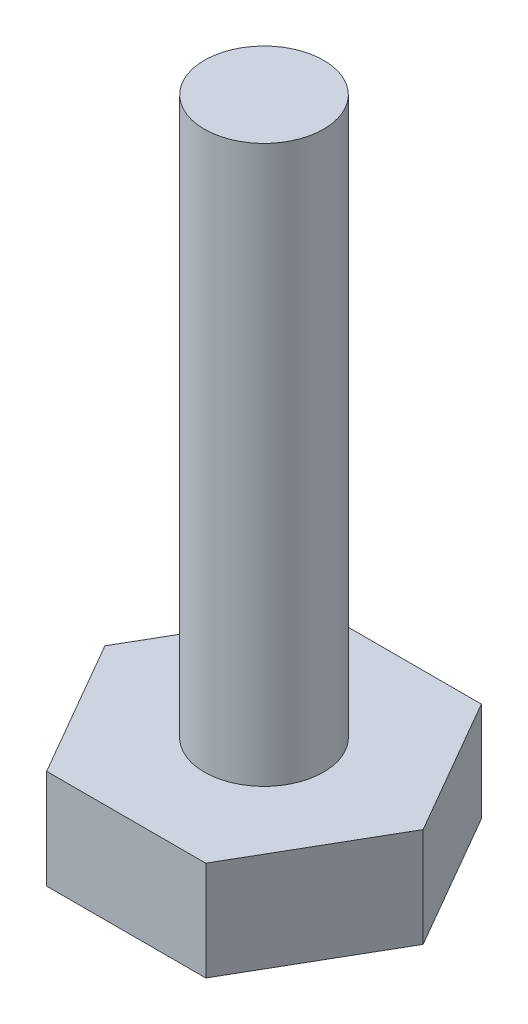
ISO-10303-21;
HEADER;
FILE_DESCRIPTION(('STEP AP214'),'2;1');
FILE_NAME('part.step','',(''),(''),'','','');
FILE_SCHEMA(('AUTOMOTIVE_DESIGN { 1 0 10303 214 1 1 1 1 }'));
ENDSEC;
DATA;
#1=APPLICATION_CONTEXT('core data for automotive mechanical design processes');
#2=APPLICATION_PROTOCOL_DEFINITION('international standard','automotive_design',2000,#1);
#3=PRODUCT_CONTEXT('',#1,'mechanical');
#4=PRODUCT('Part','Part','',(#3));
#5=PRODUCT_RELATED_PRODUCT_CATEGORY('part','',(#4));
#6=PRODUCT_DEFINITION_FORMATION('','',#4);
#7=PRODUCT_DEFINITION_CONTEXT('part definition',#1,'design');
#8=PRODUCT_DEFINITION('design','',#6,#7);
#9=PRODUCT_DEFINITION_SHAPE('','',#8);
#10=(LENGTH_UNIT() NAMED_UNIT(*) SI_UNIT(.MILLI.,.METRE.));
#11=(NAMED_UNIT(*) PLANE_ANGLE_UNIT() SI_UNIT($,.RADIAN.));
#12=(NAMED_UNIT(*) SI_UNIT($,.STERADIAN.) SOLID_ANGLE_UNIT());
#13=UNCERTAINTY_MEASURE_WITH_UNIT(LENGTH_MEASURE(1.E-05),#10,'distance_accuracy_value','');
#14=(GEOMETRIC_REPRESENTATION_CONTEXT(3) GLOBAL_UNCERTAINTY_ASSIGNED_CONTEXT((#13)) GLOBAL_UNIT_ASSIGNED_CONTEXT((#10,
#11,#12)) REPRESENTATION_CONTEXT('',''));
#15=CARTESIAN_POINT('',(0.,0.,0.));
#16=DIRECTION('',(0.,0.,1.));
#17=DIRECTION('',(1.,0.,0.));
#18=AXIS2_PLACEMENT_3D('',#15,#16,#17);
#19=CARTESIAN_POINT('',(20.,12.5,0.));
#20=DIRECTION('',(0.,1.,0.));
#21=DIRECTION('',(0.,0.,1.));
#22=AXIS2_PLACEMENT_3D('',#19,#20,#21);
#23=PLANE('',#22);
#24=DIRECTION('',(0.5,0.,-0.866025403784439));
#25=VECTOR('',#24,1.);
#26=CARTESIAN_POINT('',(9.99999999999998,12.5,17.3205080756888));
#27=LINE('',#26,#25);
#28=CARTESIAN_POINT('',(9.99999999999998,12.5,17.3205080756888));
#29=VERTEX_POINT('',#28);
#30=CARTESIAN_POINT('',(20.,12.5,0.));
#31=VERTEX_POINT('',#30);
#32=EDGE_CURVE('E132',#29,#31,#27,.T.);
#33=ORIENTED_EDGE('',*,*,#32,.T.);
#34=DIRECTION('',(-0.5,0.,-0.866025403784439));
#35=VECTOR('',#34,1.);
#36=CARTESIAN_POINT('',(20.,12.5,0.));
#37=LINE('',#36,#35);
#38=CARTESIAN_POINT('',(10.,12.5,-17.3205080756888));
#39=VERTEX_POINT('',#38);
#40=EDGE_CURVE('E90',#31,#39,#37,.T.);
#41=ORIENTED_EDGE('',*,*,#40,.T.);
#42=DIRECTION('',(-1.,0.,0.));
#43=VECTOR('',#42,1.);
#44=CARTESIAN_POINT('',(10.,12.5,-17.3205080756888));
#45=LINE('',#44,#43);
#46=CARTESIAN_POINT('',(-10.,12.5,-17.3205080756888));
#47=VERTEX_POINT('',#46);
#48=EDGE_CURVE('E103',#39,#47,#45,.T.);
#49=ORIENTED_EDGE('',*,*,#48,.T.);
#50=DIRECTION('',(-0.5,0.,0.866025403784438));
#51=VECTOR('',#50,1.);
#52=CARTESIAN_POINT('',(-10.,12.5,-17.3205080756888));
#53=LINE('',#52,#51);
#54=CARTESIAN_POINT('',(-20.,12.5,0.));
#55=VERTEX_POINT('',#54);
#56=EDGE_CURVE('E97',#47,#55,#53,.T.);
#57=ORIENTED_EDGE('',*,*,#56,.T.);
#58=DIRECTION('',(0.5,0.,0.866025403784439));
#59=VECTOR('',#58,1.);
#60=CARTESIAN_POINT('',(-20.,12.5,0.));
#61=LINE('',#60,#59);
#62=CARTESIAN_POINT('',(-10.,12.5,17.3205080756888));
#63=VERTEX_POINT('',#62);
#64=EDGE_CURVE('E101',#55,#63,#61,.T.);
#65=ORIENTED_EDGE('',*,*,#64,.T.);
#66=DIRECTION('',(1.,0.,0.));
#67=VECTOR('',#66,1.);
#68=CARTESIAN_POINT('',(-10.,12.5,17.3205080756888));
#69=LINE('',#68,#67);
#70=EDGE_CURVE('E53',#63,#29,#69,.T.);
#71=ORIENTED_EDGE('',*,*,#70,.T.);
#72=EDGE_LOOP('',(#33,#41,#49,#57,#65,#71));
#73=FACE_BOUND('',#72,.T.);
#74=CARTESIAN_POINT('',(0.,12.5,0.));
#75=DIRECTION('',(0.,1.,0.));
#76=DIRECTION('',(0.,0.,1.));
#77=AXIS2_PLACEMENT_3D('',#74,#75,#76);
#78=CIRCLE('',#77,7.5);
#79=CARTESIAN_POINT('',(0.,12.5,7.5));
#80=VERTEX_POINT('',#79);
#81=EDGE_CURVE('E172',#80,#80,#78,.T.);
#82=ORIENTED_EDGE('',*,*,#81,.F.);
#83=EDGE_LOOP('',(#82));
#84=FACE_BOUND('',#83,.T.);
#85=ADVANCED_FACE('F36',(#73,#84),#23,.T.);
#86=CARTESIAN_POINT('',(9.99999999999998,12.5,17.3205080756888));
#87=DIRECTION('',(-0.866025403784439,0.,-0.5));
#88=DIRECTION('',(-0.5,0.,0.866025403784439));
#89=AXIS2_PLACEMENT_3D('',#86,#87,#88);
#90=PLANE('',#89);
#91=DIRECTION('',(0.5,0.,-0.866025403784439));
#92=VECTOR('',#91,1.);
#93=CARTESIAN_POINT('',(9.99999999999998,0.,17.3205080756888));
#94=LINE('',#93,#92);
#95=CARTESIAN_POINT('',(9.99999999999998,0.,17.3205080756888));
#96=VERTEX_POINT('',#95);
#97=CARTESIAN_POINT('',(20.,0.,0.));
#98=VERTEX_POINT('',#97);
#99=EDGE_CURVE('E121',#96,#98,#94,.T.);
#100=ORIENTED_EDGE('',*,*,#99,.T.);
#101=DIRECTION('',(0.,-1.,0.));
#102=VECTOR('',#101,1.);
#103=CARTESIAN_POINT('',(20.,12.5,0.));
#104=LINE('',#103,#102);
#105=EDGE_CURVE('E11',#31,#98,#104,.T.);
#106=ORIENTED_EDGE('',*,*,#105,.F.);
#107=ORIENTED_EDGE('',*,*,#32,.F.);
#108=DIRECTION('',(0.,-1.,0.));
#109=VECTOR('',#108,1.);
#110=CARTESIAN_POINT('',(9.99999999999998,12.5,17.3205080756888));
#111=LINE('',#110,#109);
#112=EDGE_CURVE('E117',#29,#96,#111,.T.);
#113=ORIENTED_EDGE('',*,*,#112,.T.);
#114=EDGE_LOOP('',(#100,#106,#107,#113));
#115=FACE_BOUND('',#114,.T.);
#116=ADVANCED_FACE('F38',(#115),#90,.F.);
#117=CARTESIAN_POINT('',(20.,12.5,0.));
#118=DIRECTION('',(-0.866025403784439,0.,0.5));
#119=DIRECTION('',(0.5,0.,0.866025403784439));
#120=AXIS2_PLACEMENT_3D('',#117,#118,#119);
#121=PLANE('',#120);
#122=DIRECTION('',(-0.5,0.,-0.866025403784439));
#123=VECTOR('',#122,1.);
#124=CARTESIAN_POINT('',(20.,0.,0.));
#125=LINE('',#124,#123);
#126=CARTESIAN_POINT('',(10.,0.,-17.3205080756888));
#127=VERTEX_POINT('',#126);
#128=EDGE_CURVE('E124',#98,#127,#125,.T.);
#129=ORIENTED_EDGE('',*,*,#128,.T.);
#130=DIRECTION('',(0.,-1.,0.));
#131=VECTOR('',#130,1.);
#132=CARTESIAN_POINT('',(10.,12.5,-17.3205080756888));
#133=LINE('',#132,#131);
#134=EDGE_CURVE('E45',#39,#127,#133,.T.);
#135=ORIENTED_EDGE('',*,*,#134,.F.);
#136=ORIENTED_EDGE('',*,*,#40,.F.);
#137=ORIENTED_EDGE('',*,*,#105,.T.);
#138=EDGE_LOOP('',(#129,#135,#136,#137));
#139=FACE_BOUND('',#138,.T.);
#140=ADVANCED_FACE('F160',(#139),#121,.F.);
#141=CARTESIAN_POINT('',(10.,12.5,-17.3205080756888));
#142=DIRECTION('',(0.,0.,1.));
#143=DIRECTION('',(1.,0.,0.));
#144=AXIS2_PLACEMENT_3D('',#141,#142,#143);
#145=PLANE('',#144);
#146=DIRECTION('',(-1.,0.,0.));
#147=VECTOR('',#146,1.);
#148=CARTESIAN_POINT('',(10.,0.,-17.3205080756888));
#149=LINE('',#148,#147);
#150=CARTESIAN_POINT('',(-10.,0.,-17.3205080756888));
#151=VERTEX_POINT('',#150);
#152=EDGE_CURVE('E127',#127,#151,#149,.T.);
#153=ORIENTED_EDGE('',*,*,#152,.T.);
#154=DIRECTION('',(0.,-1.,0.));
#155=VECTOR('',#154,1.);
#156=CARTESIAN_POINT('',(-10.,12.5,-17.3205080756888));
#157=LINE('',#156,#155);
#158=EDGE_CURVE('E112',#47,#151,#157,.T.);
#159=ORIENTED_EDGE('',*,*,#158,.F.);
#160=ORIENTED_EDGE('',*,*,#48,.F.);
#161=ORIENTED_EDGE('',*,*,#134,.T.);
#162=EDGE_LOOP('',(#153,#159,#160,#161));
#163=FACE_BOUND('',#162,.T.);
#164=ADVANCED_FACE('F138',(#163),#145,.F.);
#165=CARTESIAN_POINT('',(-10.,12.5,-17.3205080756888));
#166=DIRECTION('',(0.866025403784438,0.,0.5));
#167=DIRECTION('',(0.5,0.,-0.866025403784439));
#168=AXIS2_PLACEMENT_3D('',#165,#166,#167);
#169=PLANE('',#168);
#170=DIRECTION('',(-0.5,0.,0.866025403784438));
#171=VECTOR('',#170,1.);
#172=CARTESIAN_POINT('',(-10.,0.,-17.3205080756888));
#173=LINE('',#172,#171);
#174=CARTESIAN_POINT('',(-20.,0.,0.));
#175=VERTEX_POINT('',#174);
#176=EDGE_CURVE('E111',#151,#175,#173,.T.);
#177=ORIENTED_EDGE('',*,*,#176,.T.);
#178=DIRECTION('',(0.,-1.,0.));
#179=VECTOR('',#178,1.);
#180=CARTESIAN_POINT('',(-20.,12.5,0.));
#181=LINE('',#180,#179);
#182=EDGE_CURVE('E108',#55,#175,#181,.T.);
#183=ORIENTED_EDGE('',*,*,#182,.F.);
#184=ORIENTED_EDGE('',*,*,#56,.F.);
#185=ORIENTED_EDGE('',*,*,#158,.T.);
#186=EDGE_LOOP('',(#177,#183,#184,#185));
#187=FACE_BOUND('',#186,.T.);
#188=ADVANCED_FACE('F109',(#187),#169,.F.);
#189=CARTESIAN_POINT('',(-20.,12.5,0.));
#190=DIRECTION('',(0.866025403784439,0.,-0.5));
#191=DIRECTION('',(-0.5,0.,-0.866025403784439));
#192=AXIS2_PLACEMENT_3D('',#189,#190,#191);
#193=PLANE('',#192);
#194=DIRECTION('',(0.5,0.,0.866025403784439));
#195=VECTOR('',#194,1.);
#196=CARTESIAN_POINT('',(-20.,0.,0.));
#197=LINE('',#196,#195);
#198=CARTESIAN_POINT('',(-10.,0.,17.3205080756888));
#199=VERTEX_POINT('',#198);
#200=EDGE_CURVE('E76',#175,#199,#197,.T.);
#201=ORIENTED_EDGE('',*,*,#200,.T.);
#202=DIRECTION('',(0.,-1.,0.));
#203=VECTOR('',#202,1.);
#204=CARTESIAN_POINT('',(-10.,12.5,17.3205080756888));
#205=LINE('',#204,#203);
#206=EDGE_CURVE('E113',#63,#199,#205,.T.);
#207=ORIENTED_EDGE('',*,*,#206,.F.);
#208=ORIENTED_EDGE('',*,*,#64,.F.);
#209=ORIENTED_EDGE('',*,*,#182,.T.);
#210=EDGE_LOOP('',(#201,#207,#208,#209));
#211=FACE_BOUND('',#210,.T.);
#212=ADVANCED_FACE('F115',(#211),#193,.F.);
#213=CARTESIAN_POINT('',(-10.,12.5,17.3205080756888));
#214=DIRECTION('',(0.,0.,-1.));
#215=DIRECTION('',(-1.,0.,0.));
#216=AXIS2_PLACEMENT_3D('',#213,#214,#215);
#217=PLANE('',#216);
#218=DIRECTION('',(1.,0.,0.));
#219=VECTOR('',#218,1.);
#220=CARTESIAN_POINT('',(-10.,0.,17.3205080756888));
#221=LINE('',#220,#219);
#222=EDGE_CURVE('E82',#199,#96,#221,.T.);
#223=ORIENTED_EDGE('',*,*,#222,.T.);
#224=ORIENTED_EDGE('',*,*,#112,.F.);
#225=ORIENTED_EDGE('',*,*,#70,.F.);
#226=ORIENTED_EDGE('',*,*,#206,.T.);
#227=EDGE_LOOP('',(#223,#224,#225,#226));
#228=FACE_BOUND('',#227,.T.);
#229=ADVANCED_FACE('F145',(#228),#217,.F.);
#230=CARTESIAN_POINT('',(20.,0.,0.));
#231=DIRECTION('',(0.,1.,0.));
#232=DIRECTION('',(0.,0.,1.));
#233=AXIS2_PLACEMENT_3D('',#230,#231,#232);
#234=PLANE('',#233);
#235=ORIENTED_EDGE('',*,*,#99,.F.);
#236=ORIENTED_EDGE('',*,*,#222,.F.);
#237=ORIENTED_EDGE('',*,*,#200,.F.);
#238=ORIENTED_EDGE('',*,*,#176,.F.);
#239=ORIENTED_EDGE('',*,*,#152,.F.);
#240=ORIENTED_EDGE('',*,*,#128,.F.);
#241=EDGE_LOOP('',(#235,#236,#237,#238,#239,#240));
#242=FACE_BOUND('',#241,.T.);
#243=ADVANCED_FACE('F141',(#242),#234,.F.);
#244=CARTESIAN_POINT('',(0.,82.5,0.));
#245=DIRECTION('',(0.,-1.,0.));
#246=DIRECTION('',(0.,0.,-1.));
#247=AXIS2_PLACEMENT_3D('',#244,#245,#246);
#248=CYLINDRICAL_SURFACE('',#247,7.5);
#249=CARTESIAN_POINT('',(0.,82.5,0.));
#250=DIRECTION('',(0.,1.,0.));
#251=DIRECTION('',(0.,0.,1.));
#252=AXIS2_PLACEMENT_3D('',#249,#250,#251);
#253=CIRCLE('',#252,7.5);
#254=CARTESIAN_POINT('',(0.,82.5,7.5));
#255=VERTEX_POINT('',#254);
#256=EDGE_CURVE('E125',#255,#255,#253,.T.);
#257=ORIENTED_EDGE('',*,*,#256,.F.);
#258=EDGE_LOOP('',(#257));
#259=FACE_BOUND('',#258,.T.);
#260=ORIENTED_EDGE('',*,*,#81,.T.);
#261=EDGE_LOOP('',(#260));
#262=FACE_BOUND('',#261,.T.);
#263=ADVANCED_FACE('F152',(#259,#262),#248,.T.);
#264=CARTESIAN_POINT('',(0.,82.5,0.));
#265=DIRECTION('',(0.,1.,0.));
#266=DIRECTION('',(0.,0.,1.));
#267=AXIS2_PLACEMENT_3D('',#264,#265,#266);
#268=PLANE('',#267);
#269=ORIENTED_EDGE('',*,*,#256,.T.);
#270=EDGE_LOOP('',(#269));
#271=FACE_BOUND('',#270,.T.);
#272=ADVANCED_FACE('F164',(#271),#268,.T.);
#273=CLOSED_SHELL('',(#85,#116,#140,#164,#188,#212,#229,#243,#263,#272));
#274=MANIFOLD_SOLID_BREP('B2',#273);
#275=ADVANCED_BREP_SHAPE_REPRESENTATION('',(#18,#274),#14);
#276=SHAPE_DEFINITION_REPRESENTATION(#9,#275);
ENDSEC;
END-ISO-10303-21;
